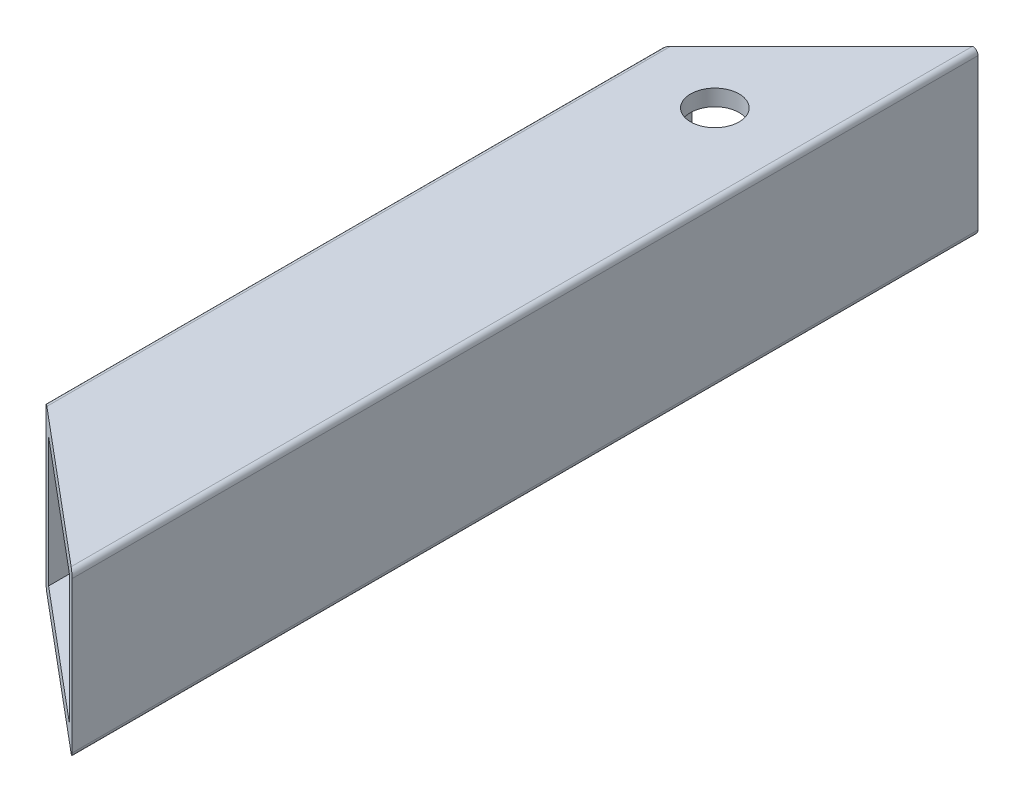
ISO-10303-21;
HEADER;
FILE_DESCRIPTION(('STEP AP214'),'2;1');
FILE_NAME('part.step','',(''),(''),'','','');
FILE_SCHEMA(('AUTOMOTIVE_DESIGN { 1 0 10303 214 1 1 1 1 }'));
ENDSEC;
DATA;
#1=APPLICATION_CONTEXT('core data for automotive mechanical design processes');
#2=APPLICATION_PROTOCOL_DEFINITION('international standard','automotive_design',2000,#1);
#3=PRODUCT_CONTEXT('',#1,'mechanical');
#4=PRODUCT('Part','Part','',(#3));
#5=PRODUCT_RELATED_PRODUCT_CATEGORY('part','',(#4));
#6=PRODUCT_DEFINITION_FORMATION('','',#4);
#7=PRODUCT_DEFINITION_CONTEXT('part definition',#1,'design');
#8=PRODUCT_DEFINITION('design','',#6,#7);
#9=PRODUCT_DEFINITION_SHAPE('','',#8);
#10=(LENGTH_UNIT() NAMED_UNIT(*) SI_UNIT(.MILLI.,.METRE.));
#11=(NAMED_UNIT(*) PLANE_ANGLE_UNIT() SI_UNIT($,.RADIAN.));
#12=(NAMED_UNIT(*) SI_UNIT($,.STERADIAN.) SOLID_ANGLE_UNIT());
#13=UNCERTAINTY_MEASURE_WITH_UNIT(LENGTH_MEASURE(1.E-05),#10,'distance_accuracy_value','');
#14=(GEOMETRIC_REPRESENTATION_CONTEXT(3) GLOBAL_UNCERTAINTY_ASSIGNED_CONTEXT((#13)) GLOBAL_UNIT_ASSIGNED_CONTEXT((#10,
#11,#12)) REPRESENTATION_CONTEXT('',''));
#15=CARTESIAN_POINT('',(0.,0.,0.));
#16=DIRECTION('',(0.,0.,1.));
#17=DIRECTION('',(1.,0.,0.));
#18=AXIS2_PLACEMENT_3D('',#15,#16,#17);
#19=CARTESIAN_POINT('',(-14.,-14.,0.));
#20=DIRECTION('',(0.,0.,-1.));
#21=DIRECTION('',(-1.,0.,0.));
#22=AXIS2_PLACEMENT_3D('',#19,#20,#21);
#23=PLANE('',#22);
#24=DIRECTION('',(0.,-1.,0.));
#25=VECTOR('',#24,1.);
#26=CARTESIAN_POINT('',(14.,15.,0.));
#27=LINE('',#26,#25);
#28=CARTESIAN_POINT('',(14.,15.,0.));
#29=VERTEX_POINT('',#28);
#30=CARTESIAN_POINT('',(14.,-15.,0.));
#31=VERTEX_POINT('',#30);
#32=EDGE_CURVE('E116',#29,#31,#27,.T.);
#33=ORIENTED_EDGE('',*,*,#32,.F.);
#34=CARTESIAN_POINT('',(14.,14.,0.));
#35=DIRECTION('',(0.,0.,1.));
#36=DIRECTION('',(1.,0.,0.));
#37=AXIS2_PLACEMENT_3D('',#34,#35,#36);
#38=CIRCLE('',#37,0.999999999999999);
#39=CARTESIAN_POINT('',(15.,14.,0.));
#40=VERTEX_POINT('',#39);
#41=EDGE_CURVE('E154',#40,#29,#38,.T.);
#42=ORIENTED_EDGE('',*,*,#41,.F.);
#43=DIRECTION('',(0.,1.,0.));
#44=VECTOR('',#43,1.);
#45=CARTESIAN_POINT('',(15.,-14.,0.));
#46=LINE('',#45,#44);
#47=CARTESIAN_POINT('',(15.,-14.,0.));
#48=VERTEX_POINT('',#47);
#49=EDGE_CURVE('E149',#48,#40,#46,.T.);
#50=ORIENTED_EDGE('',*,*,#49,.F.);
#51=CARTESIAN_POINT('',(14.,-14.,0.));
#52=DIRECTION('',(0.,0.,-1.));
#53=DIRECTION('',(-1.,0.,0.));
#54=AXIS2_PLACEMENT_3D('',#51,#52,#53);
#55=CIRCLE('',#54,1.);
#56=EDGE_CURVE('E144',#48,#31,#55,.T.);
#57=ORIENTED_EDGE('',*,*,#56,.T.);
#58=EDGE_LOOP('',(#33,#42,#50,#57));
#59=FACE_BOUND('',#58,.T.);
#60=ADVANCED_FACE('F30',(#59),#23,.T.);
#61=CARTESIAN_POINT('',(-14.,-14.,168.));
#62=DIRECTION('',(0.,0.,-1.));
#63=DIRECTION('',(-1.,0.,0.));
#64=AXIS2_PLACEMENT_3D('',#61,#62,#63);
#65=CYLINDRICAL_SURFACE('',#64,0.999999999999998);
#66=CARTESIAN_POINT('',(-14.,-14.,27.9999999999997));
#67=DIRECTION('',(0.707106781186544,0.,0.707106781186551));
#68=DIRECTION('',(0.707106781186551,0.,-0.707106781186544));
#69=AXIS2_PLACEMENT_3D('',#66,#67,#68);
#70=ELLIPSE('',#69,1.41421356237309,0.999999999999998);
#71=CARTESIAN_POINT('',(-14.,-15.,27.9999999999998));
#72=VERTEX_POINT('',#71);
#73=CARTESIAN_POINT('',(-15.,-14.,28.9999999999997));
#74=VERTEX_POINT('',#73);
#75=EDGE_CURVE('E45',#72,#74,#70,.F.);
#76=ORIENTED_EDGE('',*,*,#75,.F.);
#77=DIRECTION('',(0.,0.,-1.));
#78=VECTOR('',#77,1.);
#79=CARTESIAN_POINT('',(-14.,-15.,168.));
#80=LINE('',#79,#78);
#81=CARTESIAN_POINT('',(-14.,-15.,143.666110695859));
#82=VERTEX_POINT('',#81);
#83=EDGE_CURVE('E137',#82,#72,#80,.T.);
#84=ORIENTED_EDGE('',*,*,#83,.F.);
#85=CARTESIAN_POINT('',(-14.,-14.,143.666110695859));
#86=DIRECTION('',(0.642787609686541,0.,-0.766044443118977));
#87=DIRECTION('',(-0.766044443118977,0.,-0.642787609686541));
#88=AXIS2_PLACEMENT_3D('',#85,#86,#87);
#89=ELLIPSE('',#88,1.30540728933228,0.999999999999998);
#90=CARTESIAN_POINT('',(-15.,-14.,142.827011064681));
#91=VERTEX_POINT('',#90);
#92=EDGE_CURVE('E208',#91,#82,#89,.F.);
#93=ORIENTED_EDGE('',*,*,#92,.F.);
#94=DIRECTION('',(0.,0.,-1.));
#95=VECTOR('',#94,1.);
#96=CARTESIAN_POINT('',(-15.,-14.,168.));
#97=LINE('',#96,#95);
#98=EDGE_CURVE('E152',#91,#74,#97,.T.);
#99=ORIENTED_EDGE('',*,*,#98,.T.);
#100=EDGE_LOOP('',(#76,#84,#93,#99));
#101=FACE_BOUND('',#100,.T.);
#102=ADVANCED_FACE('F32',(#101),#65,.T.);
#103=CARTESIAN_POINT('',(14.,-15.,168.));
#104=DIRECTION('',(0.,-1.,0.));
#105=DIRECTION('',(1.,0.,0.));
#106=AXIS2_PLACEMENT_3D('',#103,#104,#105);
#107=PLANE('',#106);
#108=DIRECTION('',(-0.707106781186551,0.,0.707106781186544));
#109=VECTOR('',#108,1.);
#110=CARTESIAN_POINT('',(-38.4018848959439,-15.,52.4018848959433));
#111=LINE('',#110,#109);
#112=EDGE_CURVE('E119',#31,#72,#111,.T.);
#113=ORIENTED_EDGE('',*,*,#112,.F.);
#114=DIRECTION('',(0.,0.,-1.));
#115=VECTOR('',#114,1.);
#116=CARTESIAN_POINT('',(14.,-15.,168.));
#117=LINE('',#116,#115);
#118=CARTESIAN_POINT('',(14.,-15.,167.160900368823));
#119=VERTEX_POINT('',#118);
#120=EDGE_CURVE('E135',#119,#31,#117,.T.);
#121=ORIENTED_EDGE('',*,*,#120,.F.);
#122=DIRECTION('',(0.766044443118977,0.,0.642787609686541));
#123=VECTOR('',#122,1.);
#124=CARTESIAN_POINT('',(19.1146187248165,-15.,171.452575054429));
#125=LINE('',#124,#123);
#126=EDGE_CURVE('E181',#82,#119,#125,.T.);
#127=ORIENTED_EDGE('',*,*,#126,.F.);
#128=ORIENTED_EDGE('',*,*,#83,.T.);
#129=EDGE_LOOP('',(#113,#121,#127,#128));
#130=FACE_BOUND('',#129,.T.);
#131=CARTESIAN_POINT('',(0.,-15.,33.7989898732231));
#132=DIRECTION('',(0.,-1.,0.));
#133=DIRECTION('',(1.,0.,0.));
#134=AXIS2_PLACEMENT_3D('',#131,#132,#133);
#135=CIRCLE('',#134,4.5);
#136=CARTESIAN_POINT('',(4.5,-15.,33.7989898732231));
#137=VERTEX_POINT('',#136);
#138=EDGE_CURVE('E184',#137,#137,#135,.T.);
#139=ORIENTED_EDGE('',*,*,#138,.F.);
#140=EDGE_LOOP('',(#139));
#141=FACE_BOUND('',#140,.T.);
#142=ADVANCED_FACE('F132',(#130,#141),#107,.T.);
#143=CARTESIAN_POINT('',(14.,-14.,168.));
#144=DIRECTION('',(0.,0.,-1.));
#145=DIRECTION('',(-1.,0.,0.));
#146=AXIS2_PLACEMENT_3D('',#143,#144,#145);
#147=CYLINDRICAL_SURFACE('',#146,1.);
#148=CARTESIAN_POINT('',(14.,-14.,167.160900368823));
#149=DIRECTION('',(0.642787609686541,0.,-0.766044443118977));
#150=DIRECTION('',(-0.766044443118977,0.,-0.642787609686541));
#151=AXIS2_PLACEMENT_3D('',#148,#149,#150);
#152=ELLIPSE('',#151,1.30540728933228,1.);
#153=CARTESIAN_POINT('',(15.,-14.,168.));
#154=VERTEX_POINT('',#153);
#155=EDGE_CURVE('E145',#119,#154,#152,.F.);
#156=ORIENTED_EDGE('',*,*,#155,.F.);
#157=ORIENTED_EDGE('',*,*,#120,.T.);
#158=ORIENTED_EDGE('',*,*,#56,.F.);
#159=DIRECTION('',(0.,0.,-1.));
#160=VECTOR('',#159,1.);
#161=CARTESIAN_POINT('',(15.,-14.,168.));
#162=LINE('',#161,#160);
#163=EDGE_CURVE('E146',#154,#48,#162,.T.);
#164=ORIENTED_EDGE('',*,*,#163,.F.);
#165=EDGE_LOOP('',(#156,#157,#158,#164));
#166=FACE_BOUND('',#165,.T.);
#167=ADVANCED_FACE('F142',(#166),#147,.T.);
#168=CARTESIAN_POINT('',(15.,-14.,168.));
#169=DIRECTION('',(-1.,0.,0.));
#170=DIRECTION('',(0.,-1.,0.));
#171=AXIS2_PLACEMENT_3D('',#168,#169,#170);
#172=PLANE('',#171);
#173=ORIENTED_EDGE('',*,*,#49,.T.);
#174=DIRECTION('',(0.,0.,-1.));
#175=VECTOR('',#174,1.);
#176=CARTESIAN_POINT('',(15.,14.,168.));
#177=LINE('',#176,#175);
#178=CARTESIAN_POINT('',(15.,14.,168.));
#179=VERTEX_POINT('',#178);
#180=EDGE_CURVE('E160',#179,#40,#177,.T.);
#181=ORIENTED_EDGE('',*,*,#180,.F.);
#182=DIRECTION('',(0.,1.,0.));
#183=VECTOR('',#182,1.);
#184=CARTESIAN_POINT('',(15.,-14.,168.));
#185=LINE('',#184,#183);
#186=EDGE_CURVE('E150',#154,#179,#185,.T.);
#187=ORIENTED_EDGE('',*,*,#186,.F.);
#188=ORIENTED_EDGE('',*,*,#163,.T.);
#189=EDGE_LOOP('',(#173,#181,#187,#188));
#190=FACE_BOUND('',#189,.T.);
#191=ADVANCED_FACE('F232',(#190),#172,.F.);
#192=CARTESIAN_POINT('',(14.,14.,168.));
#193=DIRECTION('',(0.,0.,-1.));
#194=DIRECTION('',(-1.,0.,0.));
#195=AXIS2_PLACEMENT_3D('',#192,#193,#194);
#196=CYLINDRICAL_SURFACE('',#195,0.999999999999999);
#197=DIRECTION('',(0.,0.,-1.));
#198=VECTOR('',#197,1.);
#199=CARTESIAN_POINT('',(14.,15.,168.));
#200=LINE('',#199,#198);
#201=CARTESIAN_POINT('',(14.,15.,167.160900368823));
#202=VERTEX_POINT('',#201);
#203=EDGE_CURVE('E163',#202,#29,#200,.T.);
#204=ORIENTED_EDGE('',*,*,#203,.F.);
#205=CARTESIAN_POINT('',(14.,14.,167.160900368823));
#206=DIRECTION('',(0.642787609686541,0.,-0.766044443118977));
#207=DIRECTION('',(-0.766044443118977,0.,-0.642787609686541));
#208=AXIS2_PLACEMENT_3D('',#205,#206,#207);
#209=ELLIPSE('',#208,1.30540728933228,0.999999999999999);
#210=EDGE_CURVE('E210',#202,#179,#209,.T.);
#211=ORIENTED_EDGE('',*,*,#210,.T.);
#212=ORIENTED_EDGE('',*,*,#180,.T.);
#213=ORIENTED_EDGE('',*,*,#41,.T.);
#214=EDGE_LOOP('',(#204,#211,#212,#213));
#215=FACE_BOUND('',#214,.T.);
#216=ADVANCED_FACE('F228',(#215),#196,.T.);
#217=CARTESIAN_POINT('',(-14.,15.,168.));
#218=DIRECTION('',(0.,1.,0.));
#219=DIRECTION('',(0.,0.,1.));
#220=AXIS2_PLACEMENT_3D('',#217,#218,#219);
#221=PLANE('',#220);
#222=DIRECTION('',(-0.707106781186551,0.,0.707106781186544));
#223=VECTOR('',#222,1.);
#224=CARTESIAN_POINT('',(-38.4018848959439,15.,52.4018848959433));
#225=LINE('',#224,#223);
#226=CARTESIAN_POINT('',(-14.,15.,27.9999999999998));
#227=VERTEX_POINT('',#226);
#228=EDGE_CURVE('E121',#29,#227,#225,.T.);
#229=ORIENTED_EDGE('',*,*,#228,.T.);
#230=DIRECTION('',(0.,0.,-1.));
#231=VECTOR('',#230,1.);
#232=CARTESIAN_POINT('',(-14.,15.,168.));
#233=LINE('',#232,#231);
#234=CARTESIAN_POINT('',(-14.,15.,143.666110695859));
#235=VERTEX_POINT('',#234);
#236=EDGE_CURVE('E165',#235,#227,#233,.T.);
#237=ORIENTED_EDGE('',*,*,#236,.F.);
#238=DIRECTION('',(0.766044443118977,0.,0.642787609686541));
#239=VECTOR('',#238,1.);
#240=CARTESIAN_POINT('',(19.1146187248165,15.,171.452575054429));
#241=LINE('',#240,#239);
#242=EDGE_CURVE('E193',#235,#202,#241,.T.);
#243=ORIENTED_EDGE('',*,*,#242,.T.);
#244=ORIENTED_EDGE('',*,*,#203,.T.);
#245=EDGE_LOOP('',(#229,#237,#243,#244));
#246=FACE_BOUND('',#245,.T.);
#247=CARTESIAN_POINT('',(0.,15.,33.7989898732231));
#248=DIRECTION('',(0.,-1.,0.));
#249=DIRECTION('',(1.,0.,0.));
#250=AXIS2_PLACEMENT_3D('',#247,#248,#249);
#251=CIRCLE('',#250,4.5);
#252=CARTESIAN_POINT('',(4.50000000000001,15.,33.7989898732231));
#253=VERTEX_POINT('',#252);
#254=EDGE_CURVE('E177',#253,#253,#251,.T.);
#255=ORIENTED_EDGE('',*,*,#254,.T.);
#256=EDGE_LOOP('',(#255));
#257=FACE_BOUND('',#256,.T.);
#258=ADVANCED_FACE('F251',(#246,#257),#221,.T.);
#259=CARTESIAN_POINT('',(-14.,14.,168.));
#260=DIRECTION('',(0.,0.,-1.));
#261=DIRECTION('',(-1.,0.,0.));
#262=AXIS2_PLACEMENT_3D('',#259,#260,#261);
#263=CYLINDRICAL_SURFACE('',#262,0.999999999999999);
#264=CARTESIAN_POINT('',(-14.,14.,27.9999999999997));
#265=DIRECTION('',(0.707106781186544,0.,0.707106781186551));
#266=DIRECTION('',(0.707106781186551,0.,-0.707106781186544));
#267=AXIS2_PLACEMENT_3D('',#264,#265,#266);
#268=ELLIPSE('',#267,1.41421356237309,0.999999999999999);
#269=CARTESIAN_POINT('',(-15.,14.,28.9999999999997));
#270=VERTEX_POINT('',#269);
#271=EDGE_CURVE('E239',#270,#227,#268,.F.);
#272=ORIENTED_EDGE('',*,*,#271,.F.);
#273=DIRECTION('',(0.,0.,-1.));
#274=VECTOR('',#273,1.);
#275=CARTESIAN_POINT('',(-15.,14.,168.));
#276=LINE('',#275,#274);
#277=CARTESIAN_POINT('',(-15.,14.,142.827011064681));
#278=VERTEX_POINT('',#277);
#279=EDGE_CURVE('E168',#278,#270,#276,.T.);
#280=ORIENTED_EDGE('',*,*,#279,.F.);
#281=CARTESIAN_POINT('',(-14.,14.,143.666110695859));
#282=DIRECTION('',(0.642787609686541,0.,-0.766044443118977));
#283=DIRECTION('',(-0.766044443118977,0.,-0.642787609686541));
#284=AXIS2_PLACEMENT_3D('',#281,#282,#283);
#285=ELLIPSE('',#284,1.30540728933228,0.999999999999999);
#286=EDGE_CURVE('E206',#235,#278,#285,.F.);
#287=ORIENTED_EDGE('',*,*,#286,.F.);
#288=ORIENTED_EDGE('',*,*,#236,.T.);
#289=EDGE_LOOP('',(#272,#280,#287,#288));
#290=FACE_BOUND('',#289,.T.);
#291=ADVANCED_FACE('F255',(#290),#263,.T.);
#292=CARTESIAN_POINT('',(-15.,14.,168.));
#293=DIRECTION('',(1.,0.,0.));
#294=DIRECTION('',(0.,1.,0.));
#295=AXIS2_PLACEMENT_3D('',#292,#293,#294);
#296=PLANE('',#295);
#297=ORIENTED_EDGE('',*,*,#279,.T.);
#298=DIRECTION('',(0.,-1.,0.));
#299=VECTOR('',#298,1.);
#300=CARTESIAN_POINT('',(-15.,14.,28.9999999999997));
#301=LINE('',#300,#299);
#302=EDGE_CURVE('E240',#270,#74,#301,.T.);
#303=ORIENTED_EDGE('',*,*,#302,.T.);
#304=ORIENTED_EDGE('',*,*,#98,.F.);
#305=DIRECTION('',(0.,1.,0.));
#306=VECTOR('',#305,1.);
#307=CARTESIAN_POINT('',(-15.,14.,142.827011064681));
#308=LINE('',#307,#306);
#309=EDGE_CURVE('E203',#91,#278,#308,.T.);
#310=ORIENTED_EDGE('',*,*,#309,.T.);
#311=EDGE_LOOP('',(#297,#303,#304,#310));
#312=FACE_BOUND('',#311,.T.);
#313=ADVANCED_FACE('F258',(#312),#296,.F.);
#314=CARTESIAN_POINT('',(-12.,-14.,168.));
#315=DIRECTION('',(1.,0.,0.));
#316=DIRECTION('',(0.,1.,0.));
#317=AXIS2_PLACEMENT_3D('',#314,#315,#316);
#318=PLANE('',#317);
#319=DIRECTION('',(0.,-1.,0.));
#320=VECTOR('',#319,1.);
#321=CARTESIAN_POINT('',(-12.,-14.,25.9999999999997));
#322=LINE('',#321,#320);
#323=CARTESIAN_POINT('',(-12.,12.,25.9999999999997));
#324=VERTEX_POINT('',#323);
#325=CARTESIAN_POINT('',(-12.,-12.,25.9999999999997));
#326=VERTEX_POINT('',#325);
#327=EDGE_CURVE('E244',#324,#326,#322,.T.);
#328=ORIENTED_EDGE('',*,*,#327,.F.);
#329=DIRECTION('',(0.,0.,-1.));
#330=VECTOR('',#329,1.);
#331=CARTESIAN_POINT('',(-12.,12.,168.));
#332=LINE('',#331,#330);
#333=CARTESIAN_POINT('',(-12.,12.,145.344309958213));
#334=VERTEX_POINT('',#333);
#335=EDGE_CURVE('E214',#334,#324,#332,.T.);
#336=ORIENTED_EDGE('',*,*,#335,.F.);
#337=DIRECTION('',(0.,1.,0.));
#338=VECTOR('',#337,1.);
#339=CARTESIAN_POINT('',(-12.,-14.,145.344309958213));
#340=LINE('',#339,#338);
#341=CARTESIAN_POINT('',(-12.,-12.,145.344309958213));
#342=VERTEX_POINT('',#341);
#343=EDGE_CURVE('E201',#342,#334,#340,.T.);
#344=ORIENTED_EDGE('',*,*,#343,.F.);
#345=DIRECTION('',(0.,0.,-1.));
#346=VECTOR('',#345,1.);
#347=CARTESIAN_POINT('',(-12.,-12.,168.));
#348=LINE('',#347,#346);
#349=EDGE_CURVE('E223',#342,#326,#348,.T.);
#350=ORIENTED_EDGE('',*,*,#349,.T.);
#351=EDGE_LOOP('',(#328,#336,#344,#350));
#352=FACE_BOUND('',#351,.T.);
#353=ADVANCED_FACE('F260',(#352),#318,.T.);
#354=CARTESIAN_POINT('',(-14.,-12.,168.));
#355=DIRECTION('',(0.,-1.,0.));
#356=DIRECTION('',(1.,0.,0.));
#357=AXIS2_PLACEMENT_3D('',#354,#355,#356);
#358=PLANE('',#357);
#359=CARTESIAN_POINT('',(0.,-12.,33.7989898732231));
#360=DIRECTION('',(0.,-1.,0.));
#361=DIRECTION('',(1.,0.,0.));
#362=AXIS2_PLACEMENT_3D('',#359,#360,#361);
#363=CIRCLE('',#362,4.5);
#364=CARTESIAN_POINT('',(4.5,-12.,33.7989898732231));
#365=VERTEX_POINT('',#364);
#366=EDGE_CURVE('E176',#365,#365,#363,.T.);
#367=ORIENTED_EDGE('',*,*,#366,.T.);
#368=EDGE_LOOP('',(#367));
#369=FACE_BOUND('',#368,.T.);
#370=DIRECTION('',(0.,0.,-1.));
#371=VECTOR('',#370,1.);
#372=CARTESIAN_POINT('',(12.,-12.,168.));
#373=LINE('',#372,#371);
#374=CARTESIAN_POINT('',(12.,-12.,165.482701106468));
#375=VERTEX_POINT('',#374);
#376=CARTESIAN_POINT('',(12.,-12.,2.00000000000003));
#377=VERTEX_POINT('',#376);
#378=EDGE_CURVE('E220',#375,#377,#373,.T.);
#379=ORIENTED_EDGE('',*,*,#378,.T.);
#380=DIRECTION('',(-0.707106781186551,0.,0.707106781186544));
#381=VECTOR('',#380,1.);
#382=CARTESIAN_POINT('',(-84.0000000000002,-12.,97.9999999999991));
#383=LINE('',#382,#381);
#384=EDGE_CURVE('E52',#377,#326,#383,.T.);
#385=ORIENTED_EDGE('',*,*,#384,.T.);
#386=ORIENTED_EDGE('',*,*,#349,.F.);
#387=DIRECTION('',(0.766044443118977,0.,0.642787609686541));
#388=VECTOR('',#387,1.);
#389=CARTESIAN_POINT('',(-2.01789857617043,-12.,153.720287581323));
#390=LINE('',#389,#388);
#391=EDGE_CURVE('E198',#342,#375,#390,.T.);
#392=ORIENTED_EDGE('',*,*,#391,.T.);
#393=EDGE_LOOP('',(#379,#385,#386,#392));
#394=FACE_BOUND('',#393,.T.);
#395=ADVANCED_FACE('F265',(#369,#394),#358,.F.);
#396=CARTESIAN_POINT('',(12.,-14.,168.));
#397=DIRECTION('',(-1.,0.,0.));
#398=DIRECTION('',(0.,-1.,0.));
#399=AXIS2_PLACEMENT_3D('',#396,#397,#398);
#400=PLANE('',#399);
#401=DIRECTION('',(0.,1.,0.));
#402=VECTOR('',#401,1.);
#403=CARTESIAN_POINT('',(12.,-14.,1.99999999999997));
#404=LINE('',#403,#402);
#405=CARTESIAN_POINT('',(12.,12.,1.99999999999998));
#406=VERTEX_POINT('',#405);
#407=EDGE_CURVE('E11',#377,#406,#404,.T.);
#408=ORIENTED_EDGE('',*,*,#407,.F.);
#409=ORIENTED_EDGE('',*,*,#378,.F.);
#410=DIRECTION('',(0.,-1.,0.));
#411=VECTOR('',#410,1.);
#412=CARTESIAN_POINT('',(12.,-14.,165.482701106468));
#413=LINE('',#412,#411);
#414=CARTESIAN_POINT('',(12.,12.,165.482701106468));
#415=VERTEX_POINT('',#414);
#416=EDGE_CURVE('E196',#415,#375,#413,.T.);
#417=ORIENTED_EDGE('',*,*,#416,.F.);
#418=DIRECTION('',(0.,0.,-1.));
#419=VECTOR('',#418,1.);
#420=CARTESIAN_POINT('',(12.,12.,168.));
#421=LINE('',#420,#419);
#422=EDGE_CURVE('E217',#415,#406,#421,.T.);
#423=ORIENTED_EDGE('',*,*,#422,.T.);
#424=EDGE_LOOP('',(#408,#409,#417,#423));
#425=FACE_BOUND('',#424,.T.);
#426=ADVANCED_FACE('F312',(#425),#400,.T.);
#427=CARTESIAN_POINT('',(-14.,12.,168.));
#428=DIRECTION('',(0.,1.,0.));
#429=DIRECTION('',(0.,0.,1.));
#430=AXIS2_PLACEMENT_3D('',#427,#428,#429);
#431=PLANE('',#430);
#432=CARTESIAN_POINT('',(0.,12.,33.7989898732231));
#433=DIRECTION('',(0.,1.,0.));
#434=DIRECTION('',(0.,0.,1.));
#435=AXIS2_PLACEMENT_3D('',#432,#433,#434);
#436=CIRCLE('',#435,4.5);
#437=CARTESIAN_POINT('',(4.50000000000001,12.,33.7989898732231));
#438=VERTEX_POINT('',#437);
#439=EDGE_CURVE('E174',#438,#438,#436,.T.);
#440=ORIENTED_EDGE('',*,*,#439,.T.);
#441=EDGE_LOOP('',(#440));
#442=FACE_BOUND('',#441,.T.);
#443=ORIENTED_EDGE('',*,*,#335,.T.);
#444=DIRECTION('',(0.707106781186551,0.,-0.707106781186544));
#445=VECTOR('',#444,1.);
#446=CARTESIAN_POINT('',(-84.0000000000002,12.,97.9999999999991));
#447=LINE('',#446,#445);
#448=EDGE_CURVE('E126',#324,#406,#447,.T.);
#449=ORIENTED_EDGE('',*,*,#448,.T.);
#450=ORIENTED_EDGE('',*,*,#422,.F.);
#451=DIRECTION('',(-0.766044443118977,0.,-0.642787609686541));
#452=VECTOR('',#451,1.);
#453=CARTESIAN_POINT('',(-2.01789857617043,12.,153.720287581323));
#454=LINE('',#453,#452);
#455=EDGE_CURVE('E38',#415,#334,#454,.T.);
#456=ORIENTED_EDGE('',*,*,#455,.T.);
#457=EDGE_LOOP('',(#443,#449,#450,#456));
#458=FACE_BOUND('',#457,.T.);
#459=ADVANCED_FACE('F321',(#442,#458),#431,.F.);
#460=CARTESIAN_POINT('',(19.1146187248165,15.,171.452575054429));
#461=DIRECTION('',(0.642787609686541,0.,-0.766044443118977));
#462=DIRECTION('',(-0.766044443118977,0.,-0.642787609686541));
#463=AXIS2_PLACEMENT_3D('',#460,#461,#462);
#464=PLANE('',#463);
#465=ORIENTED_EDGE('',*,*,#155,.T.);
#466=ORIENTED_EDGE('',*,*,#186,.T.);
#467=ORIENTED_EDGE('',*,*,#210,.F.);
#468=ORIENTED_EDGE('',*,*,#242,.F.);
#469=ORIENTED_EDGE('',*,*,#286,.T.);
#470=ORIENTED_EDGE('',*,*,#309,.F.);
#471=ORIENTED_EDGE('',*,*,#92,.T.);
#472=ORIENTED_EDGE('',*,*,#126,.T.);
#473=EDGE_LOOP('',(#465,#466,#467,#468,#469,#470,#471,#472));
#474=FACE_BOUND('',#473,.T.);
#475=ORIENTED_EDGE('',*,*,#343,.T.);
#476=ORIENTED_EDGE('',*,*,#455,.F.);
#477=ORIENTED_EDGE('',*,*,#416,.T.);
#478=ORIENTED_EDGE('',*,*,#391,.F.);
#479=EDGE_LOOP('',(#475,#476,#477,#478));
#480=FACE_BOUND('',#479,.T.);
#481=ADVANCED_FACE('F234',(#474,#480),#464,.F.);
#482=CARTESIAN_POINT('',(0.,15.,33.7989898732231));
#483=DIRECTION('',(0.,-1.,0.));
#484=DIRECTION('',(1.,0.,0.));
#485=AXIS2_PLACEMENT_3D('',#482,#483,#484);
#486=CYLINDRICAL_SURFACE('',#485,4.5);
#487=CARTESIAN_POINT('',(4.50000000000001,15.,33.7989898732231));
#488=CARTESIAN_POINT('',(4.50000000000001,14.96875,33.7989898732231));
#489=CARTESIAN_POINT('',(4.50000000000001,14.9375,33.7989898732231));
#490=CARTESIAN_POINT('',(4.50000000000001,14.875,33.7989898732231));
#491=CARTESIAN_POINT('',(4.50000000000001,14.84375,33.7989898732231));
#492=CARTESIAN_POINT('',(4.50000000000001,14.78125,33.7989898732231));
#493=CARTESIAN_POINT('',(4.50000000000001,14.75,33.7989898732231));
#494=CARTESIAN_POINT('',(4.50000000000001,14.6875,33.7989898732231));
#495=CARTESIAN_POINT('',(4.50000000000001,14.65625,33.7989898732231));
#496=CARTESIAN_POINT('',(4.50000000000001,14.59375,33.7989898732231));
#497=CARTESIAN_POINT('',(4.50000000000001,14.5625,33.7989898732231));
#498=CARTESIAN_POINT('',(4.50000000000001,14.5,33.7989898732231));
#499=CARTESIAN_POINT('',(4.50000000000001,14.46875,33.7989898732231));
#500=CARTESIAN_POINT('',(4.50000000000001,14.40625,33.7989898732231));
#501=CARTESIAN_POINT('',(4.50000000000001,14.375,33.7989898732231));
#502=CARTESIAN_POINT('',(4.50000000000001,14.3125,33.7989898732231));
#503=CARTESIAN_POINT('',(4.50000000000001,14.28125,33.7989898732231));
#504=CARTESIAN_POINT('',(4.50000000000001,14.21875,33.7989898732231));
#505=CARTESIAN_POINT('',(4.50000000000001,14.1875,33.7989898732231));
#506=CARTESIAN_POINT('',(4.50000000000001,14.125,33.7989898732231));
#507=CARTESIAN_POINT('',(4.50000000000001,14.09375,33.7989898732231));
#508=CARTESIAN_POINT('',(4.50000000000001,14.03125,33.7989898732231));
#509=CARTESIAN_POINT('',(4.50000000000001,14.,33.7989898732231));
#510=CARTESIAN_POINT('',(4.50000000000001,13.9375,33.7989898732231));
#511=CARTESIAN_POINT('',(4.50000000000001,13.90625,33.7989898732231));
#512=CARTESIAN_POINT('',(4.50000000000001,13.84375,33.7989898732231));
#513=CARTESIAN_POINT('',(4.50000000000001,13.8125,33.7989898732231));
#514=CARTESIAN_POINT('',(4.50000000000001,13.75,33.7989898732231));
#515=CARTESIAN_POINT('',(4.50000000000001,13.71875,33.7989898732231));
#516=CARTESIAN_POINT('',(4.50000000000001,13.65625,33.7989898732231));
#517=CARTESIAN_POINT('',(4.50000000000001,13.625,33.7989898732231));
#518=CARTESIAN_POINT('',(4.50000000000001,13.5625,33.7989898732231));
#519=CARTESIAN_POINT('',(4.50000000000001,13.53125,33.7989898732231));
#520=CARTESIAN_POINT('',(4.50000000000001,13.46875,33.7989898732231));
#521=CARTESIAN_POINT('',(4.50000000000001,13.4375,33.7989898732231));
#522=CARTESIAN_POINT('',(4.50000000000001,13.375,33.7989898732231));
#523=CARTESIAN_POINT('',(4.50000000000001,13.34375,33.7989898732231));
#524=CARTESIAN_POINT('',(4.50000000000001,13.28125,33.7989898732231));
#525=CARTESIAN_POINT('',(4.50000000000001,13.25,33.7989898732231));
#526=CARTESIAN_POINT('',(4.50000000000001,13.1875,33.7989898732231));
#527=CARTESIAN_POINT('',(4.50000000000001,13.15625,33.7989898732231));
#528=CARTESIAN_POINT('',(4.50000000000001,13.09375,33.7989898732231));
#529=CARTESIAN_POINT('',(4.50000000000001,13.0625,33.7989898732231));
#530=CARTESIAN_POINT('',(4.50000000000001,13.,33.7989898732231));
#531=CARTESIAN_POINT('',(4.50000000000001,12.96875,33.7989898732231));
#532=CARTESIAN_POINT('',(4.50000000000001,12.90625,33.7989898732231));
#533=CARTESIAN_POINT('',(4.50000000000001,12.875,33.7989898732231));
#534=CARTESIAN_POINT('',(4.50000000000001,12.8125,33.7989898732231));
#535=CARTESIAN_POINT('',(4.50000000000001,12.78125,33.7989898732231));
#536=CARTESIAN_POINT('',(4.50000000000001,12.71875,33.7989898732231));
#537=CARTESIAN_POINT('',(4.50000000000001,12.6875,33.7989898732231));
#538=CARTESIAN_POINT('',(4.50000000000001,12.625,33.7989898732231));
#539=CARTESIAN_POINT('',(4.50000000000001,12.59375,33.7989898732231));
#540=CARTESIAN_POINT('',(4.50000000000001,12.53125,33.7989898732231));
#541=CARTESIAN_POINT('',(4.50000000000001,12.5,33.7989898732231));
#542=CARTESIAN_POINT('',(4.50000000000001,12.4375,33.7989898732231));
#543=CARTESIAN_POINT('',(4.50000000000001,12.40625,33.7989898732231));
#544=CARTESIAN_POINT('',(4.50000000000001,12.34375,33.7989898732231));
#545=CARTESIAN_POINT('',(4.50000000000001,12.3125,33.7989898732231));
#546=CARTESIAN_POINT('',(4.50000000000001,12.25,33.7989898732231));
#547=CARTESIAN_POINT('',(4.50000000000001,12.21875,33.7989898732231));
#548=CARTESIAN_POINT('',(4.50000000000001,12.15625,33.7989898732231));
#549=CARTESIAN_POINT('',(4.50000000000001,12.125,33.7989898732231));
#550=CARTESIAN_POINT('',(4.50000000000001,12.0625,33.7989898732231));
#551=CARTESIAN_POINT('',(4.50000000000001,12.03125,33.7989898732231));
#552=CARTESIAN_POINT('',(4.50000000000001,12.,33.7989898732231));
#553=B_SPLINE_CURVE_WITH_KNOTS('',3,(#487,#488,#489,#490,#491,#492,#493,#494,#495,#496,#497,
#498,#499,#500,#501,#502,#503,#504,#505,#506,#507,#508,#509,#510,#511,#512,#513,#514,#515,#516,
#517,#518,#519,#520,#521,#522,#523,#524,#525,#526,#527,#528,#529,#530,#531,#532,#533,#534,#535,
#536,#537,#538,#539,#540,#541,#542,#543,#544,#545,#546,#547,#548,#549,#550,#551,#552),
.UNSPECIFIED.,.F.,.F.,(4,2,2,2,2,2,2,2,2,2,2,2,2,2,2,2,2,2,2,2,2,2,2,2,2,2,2,2,2,2,2,2,4),(0.,
0.0937499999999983,0.187499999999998,0.281249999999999,0.374999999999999,0.468749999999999,
0.562499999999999,0.656249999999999,0.749999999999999,0.843749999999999,0.937499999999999,
1.03125,1.125,1.21875,1.3125,1.40625,1.5,1.59375,1.6875,1.78125,1.875,1.96875,2.0625,2.15625,
2.25,2.34375,2.4375,2.53125,2.625,2.71875,2.8125,2.90625,3.),.UNSPECIFIED.);
#554=EDGE_CURVE('BSEAM339',#253,#438,#553,.T.);
#555=ORIENTED_EDGE('',*,*,#254,.F.);
#556=ORIENTED_EDGE('',*,*,#439,.F.);
#557=ORIENTED_EDGE('',*,*,#554,.T.);
#558=ORIENTED_EDGE('',*,*,#554,.F.);
#559=EDGE_LOOP('',(#555,#557,#556,#558));
#560=FACE_BOUND('',#559,.T.);
#561=ADVANCED_FACE('F339',(#560),#486,.F.);
#562=CARTESIAN_POINT('',(4.5,-15.,33.7989898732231));
#563=CARTESIAN_POINT('',(4.5,-14.96875,33.7989898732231));
#564=CARTESIAN_POINT('',(4.5,-14.9375,33.7989898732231));
#565=CARTESIAN_POINT('',(4.5,-14.875,33.7989898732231));
#566=CARTESIAN_POINT('',(4.5,-14.84375,33.7989898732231));
#567=CARTESIAN_POINT('',(4.5,-14.78125,33.7989898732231));
#568=CARTESIAN_POINT('',(4.5,-14.75,33.7989898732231));
#569=CARTESIAN_POINT('',(4.5,-14.6875,33.7989898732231));
#570=CARTESIAN_POINT('',(4.5,-14.65625,33.7989898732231));
#571=CARTESIAN_POINT('',(4.5,-14.59375,33.7989898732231));
#572=CARTESIAN_POINT('',(4.5,-14.5625,33.7989898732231));
#573=CARTESIAN_POINT('',(4.5,-14.5,33.7989898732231));
#574=CARTESIAN_POINT('',(4.5,-14.46875,33.7989898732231));
#575=CARTESIAN_POINT('',(4.5,-14.40625,33.7989898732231));
#576=CARTESIAN_POINT('',(4.5,-14.375,33.7989898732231));
#577=CARTESIAN_POINT('',(4.5,-14.3125,33.7989898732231));
#578=CARTESIAN_POINT('',(4.5,-14.28125,33.7989898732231));
#579=CARTESIAN_POINT('',(4.5,-14.21875,33.7989898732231));
#580=CARTESIAN_POINT('',(4.5,-14.1875,33.7989898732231));
#581=CARTESIAN_POINT('',(4.5,-14.125,33.7989898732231));
#582=CARTESIAN_POINT('',(4.5,-14.09375,33.7989898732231));
#583=CARTESIAN_POINT('',(4.5,-14.03125,33.7989898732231));
#584=CARTESIAN_POINT('',(4.5,-14.,33.7989898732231));
#585=CARTESIAN_POINT('',(4.5,-13.9375,33.7989898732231));
#586=CARTESIAN_POINT('',(4.5,-13.90625,33.7989898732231));
#587=CARTESIAN_POINT('',(4.5,-13.84375,33.7989898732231));
#588=CARTESIAN_POINT('',(4.5,-13.8125,33.7989898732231));
#589=CARTESIAN_POINT('',(4.5,-13.75,33.7989898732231));
#590=CARTESIAN_POINT('',(4.5,-13.71875,33.7989898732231));
#591=CARTESIAN_POINT('',(4.5,-13.65625,33.7989898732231));
#592=CARTESIAN_POINT('',(4.5,-13.625,33.7989898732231));
#593=CARTESIAN_POINT('',(4.5,-13.5625,33.7989898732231));
#594=CARTESIAN_POINT('',(4.5,-13.53125,33.7989898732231));
#595=CARTESIAN_POINT('',(4.5,-13.46875,33.7989898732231));
#596=CARTESIAN_POINT('',(4.5,-13.4375,33.7989898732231));
#597=CARTESIAN_POINT('',(4.5,-13.375,33.7989898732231));
#598=CARTESIAN_POINT('',(4.5,-13.34375,33.7989898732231));
#599=CARTESIAN_POINT('',(4.5,-13.28125,33.7989898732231));
#600=CARTESIAN_POINT('',(4.5,-13.25,33.7989898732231));
#601=CARTESIAN_POINT('',(4.5,-13.1875,33.7989898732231));
#602=CARTESIAN_POINT('',(4.5,-13.15625,33.7989898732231));
#603=CARTESIAN_POINT('',(4.5,-13.09375,33.7989898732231));
#604=CARTESIAN_POINT('',(4.5,-13.0625,33.7989898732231));
#605=CARTESIAN_POINT('',(4.5,-13.,33.7989898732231));
#606=CARTESIAN_POINT('',(4.5,-12.96875,33.7989898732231));
#607=CARTESIAN_POINT('',(4.5,-12.90625,33.7989898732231));
#608=CARTESIAN_POINT('',(4.5,-12.875,33.7989898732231));
#609=CARTESIAN_POINT('',(4.5,-12.8125,33.7989898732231));
#610=CARTESIAN_POINT('',(4.5,-12.78125,33.7989898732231));
#611=CARTESIAN_POINT('',(4.5,-12.71875,33.7989898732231));
#612=CARTESIAN_POINT('',(4.5,-12.6875,33.7989898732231));
#613=CARTESIAN_POINT('',(4.5,-12.625,33.7989898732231));
#614=CARTESIAN_POINT('',(4.5,-12.59375,33.7989898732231));
#615=CARTESIAN_POINT('',(4.5,-12.53125,33.7989898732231));
#616=CARTESIAN_POINT('',(4.5,-12.5,33.7989898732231));
#617=CARTESIAN_POINT('',(4.5,-12.4375,33.7989898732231));
#618=CARTESIAN_POINT('',(4.5,-12.40625,33.7989898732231));
#619=CARTESIAN_POINT('',(4.5,-12.34375,33.7989898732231));
#620=CARTESIAN_POINT('',(4.5,-12.3125,33.7989898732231));
#621=CARTESIAN_POINT('',(4.5,-12.25,33.7989898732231));
#622=CARTESIAN_POINT('',(4.5,-12.21875,33.7989898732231));
#623=CARTESIAN_POINT('',(4.5,-12.15625,33.7989898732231));
#624=CARTESIAN_POINT('',(4.5,-12.125,33.7989898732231));
#625=CARTESIAN_POINT('',(4.5,-12.0625,33.7989898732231));
#626=CARTESIAN_POINT('',(4.5,-12.03125,33.7989898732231));
#627=CARTESIAN_POINT('',(4.5,-12.,33.7989898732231));
#628=B_SPLINE_CURVE_WITH_KNOTS('',3,(#562,#563,#564,#565,#566,#567,#568,#569,#570,#571,#572,
#573,#574,#575,#576,#577,#578,#579,#580,#581,#582,#583,#584,#585,#586,#587,#588,#589,#590,#591,
#592,#593,#594,#595,#596,#597,#598,#599,#600,#601,#602,#603,#604,#605,#606,#607,#608,#609,#610,
#611,#612,#613,#614,#615,#616,#617,#618,#619,#620,#621,#622,#623,#624,#625,#626,#627),
.UNSPECIFIED.,.F.,.F.,(4,2,2,2,2,2,2,2,2,2,2,2,2,2,2,2,2,2,2,2,2,2,2,2,2,2,2,2,2,2,2,2,4),(0.,
0.0937500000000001,0.1875,0.28125,0.375,0.46875,0.5625,0.656250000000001,0.750000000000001,
0.843749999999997,0.937499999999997,1.03125,1.125,1.21875,1.3125,1.40625,1.5,1.59375,1.6875,
1.78125,1.875,1.96875,2.0625,2.15625,2.25,2.34375,2.4375,2.53125,2.625,2.71875,2.8125,2.90625,
3.),.UNSPECIFIED.);
#629=EDGE_CURVE('BSEAM348',#137,#365,#628,.T.);
#630=ORIENTED_EDGE('',*,*,#138,.T.);
#631=ORIENTED_EDGE('',*,*,#366,.F.);
#632=ORIENTED_EDGE('',*,*,#629,.T.);
#633=ORIENTED_EDGE('',*,*,#629,.F.);
#634=EDGE_LOOP('',(#630,#632,#631,#633));
#635=FACE_BOUND('',#634,.T.);
#636=ADVANCED_FACE('F348',(#635),#486,.F.);
#637=CARTESIAN_POINT('',(-38.4018848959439,15.,52.4018848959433));
#638=DIRECTION('',(0.707106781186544,0.,0.707106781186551));
#639=DIRECTION('',(0.707106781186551,0.,-0.707106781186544));
#640=AXIS2_PLACEMENT_3D('',#637,#638,#639);
#641=PLANE('',#640);
#642=ORIENTED_EDGE('',*,*,#75,.T.);
#643=ORIENTED_EDGE('',*,*,#302,.F.);
#644=ORIENTED_EDGE('',*,*,#271,.T.);
#645=ORIENTED_EDGE('',*,*,#228,.F.);
#646=ORIENTED_EDGE('',*,*,#32,.T.);
#647=ORIENTED_EDGE('',*,*,#112,.T.);
#648=EDGE_LOOP('',(#642,#643,#644,#645,#646,#647));
#649=FACE_BOUND('',#648,.T.);
#650=ORIENTED_EDGE('',*,*,#327,.T.);
#651=ORIENTED_EDGE('',*,*,#384,.F.);
#652=ORIENTED_EDGE('',*,*,#407,.T.);
#653=ORIENTED_EDGE('',*,*,#448,.F.);
#654=EDGE_LOOP('',(#650,#651,#652,#653));
#655=FACE_BOUND('',#654,.T.);
#656=ADVANCED_FACE('F118',(#649,#655),#641,.F.);
#657=CLOSED_SHELL('',(#60,#102,#142,#167,#191,#216,#258,#291,#313,#353,#395,#426,#459,#481,#561,
#636,#656));
#658=MANIFOLD_SOLID_BREP('B2',#657);
#659=ADVANCED_BREP_SHAPE_REPRESENTATION('',(#18,#658),#14);
#660=SHAPE_DEFINITION_REPRESENTATION(#9,#659);
ENDSEC;
END-ISO-10303-21;
